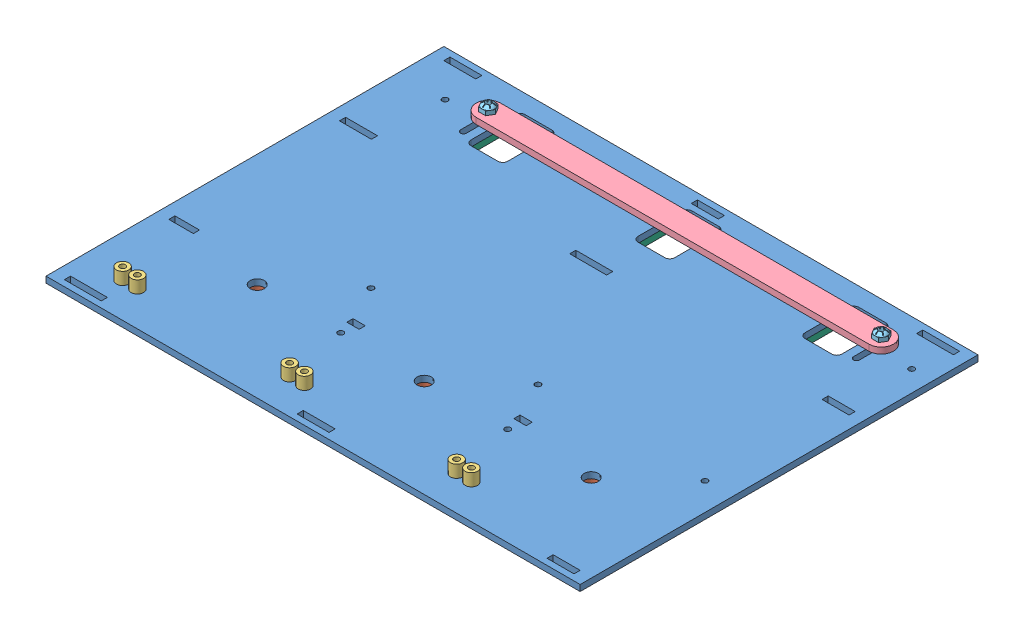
SolidWorks assembly TopAssembly.SLDASM, configuration Default (file format 7000). Lengths in mm.
Overall size (276.23 41.27 205.74).
20 component instances, 9 part files, 33 mates.
Components (placement in the parent):
- TopPanel-1: TopPanel.SLDPRT [Default] at (-16.6534 141.8014 300.2711) size (276.23 3.17 205.74)
- InputBacking-1: InputBacking.SLDPRT [Default] at (41.7666 138.6264 249.4711) size (81.07 3.17 76.2)
- Spacer-0p25-1s4-1: Spacer-0p25-1s4.SLDPRT [Default] at (12.7674 151.3264 282.4432) x (0.646996 0 -0.762494) z (0 -1 0) size (6.35 6.35 6.35)
- Spacer-0p25-1s4-2: Spacer-0p25-1s4.SLDPRT [Default] at (5.1474 151.3264 282.4432) x (0.139598 0 -0.990208) z (0 -1 0) size (6.35 6.35 6.35)
- FingerStop-1: FingerStop.SLDPRT [Default] at (5.1474 151.3264 282.4432) size (35.67 3.17 18.43)
- InputBacking-2: InputBacking.SLDPRT [Default] at (128.1266 138.6264 249.4711) size (81.07 3.17 76.2)
- Spacer-0p25-1s4-3: Spacer-0p25-1s4.SLDPRT [Default] at (91.5074 151.3264 282.4432) x (0.999262 0 0.038412) z (0 -1 0) size (6.35 6.35 6.35)
- Spacer-0p25-1s4-4: Spacer-0p25-1s4.SLDPRT [Default] at (99.1274 151.3264 282.4432) x (0.62391 0 0.781496) z (0 -1 0) size (6.35 6.35 6.35)
- FingerStop-3: FingerStop.SLDPRT [Default] at (91.5074 151.3264 282.4432) size (35.67 3.17 18.43)
- InputBacking-3: InputBacking.SLDPRT [Default] at (214.4866 138.6264 249.4711) size (81.07 3.17 76.2)
- Spacer-0p25-1s4-5: Spacer-0p25-1s4.SLDPRT [Default] at (185.4874 151.3264 282.4432) x (0.993795 0 0.111224) z (0 -1 0) size (6.35 6.35 6.35)
- Spacer-0p25-1s4-6: Spacer-0p25-1s4.SLDPRT [Default] at (177.8674 151.3264 282.4432) x (0.413398 0 0.91055) z (0 -1 0) size (6.35 6.35 6.35)
- FingerStop-4: FingerStop.SLDPRT [Default] at (177.8674 151.3264 282.4432) size (35.67 3.17 18.43)
- ReadoutCover-1: ReadoutCover.SLDPRT [Default] at (26.5774 144.9764 114.7787) size (215.9 3.17 12.7)
- Locknut-1: Locknut.SLDPRT [Default] at (26.5774 150.2723 114.7787) x (1 0 0) z (0 -1 0) size (7.33 6.35 3.56)
- Locknut-2: Locknut.SLDPRT [Default] at (229.7774 150.2723 114.7787) x (1 0 0) z (0 -1 0) size (7.33 6.35 3.56)
- ReadoutShield-1: ReadoutShield.SLDPRT [Default] at (1.1266 138.6264 133.2661) size (254 3.17 30.48)
- InputBrace-1: InputBrace.SLDPRT [Default] at (36.0516 113.2264 249.4711) size (196.85 3.17 12.7)
- Standoff-1in-1s4-1: Standoff-1in-1s4.SLDPRT [Default] at (171.3066 141.8014 249.4711) x (1 0 0) z (0 -1 0) size (6.35 6.35 25.4)
- Standoff-1in-1s4-2: Standoff-1in-1s4.SLDPRT [Default] at (84.9466 141.8014 249.4711) x (-0.986882 0 0.161445) z (0 -1 0) size (6.35 6.35 25.4)
Mates (geometry in assembly coordinates):
- Coincident20: coincident anti-aligned: circle of TopPanel-1; circle of Spacer-0p25-1s4-1
- Coincident21: coincident anti-aligned: circle of TopPanel-1; circle of Spacer-0p25-1s4-2
- Coincident25: coincident anti-aligned: circle of TopPanel-1; circle of Spacer-0p25-1s4-3
- Coincident29: coincident anti-aligned: circle of TopPanel-1; circle of Spacer-0p25-1s4-6
- Coincident35: coincident anti-aligned: plane of TopPanel-1 through (-16.6534 144.9764 300.2711) normal (0 1 0); plane of ReadoutCover-1 through (26.5774 144.9764 114.7787) normal (0 -1 0)
- Coincident38: coincident anti-aligned: circle of ReadoutCover-1; circle of Locknut-1
- Coincident39: coincident anti-aligned: circle of ReadoutCover-1; circle of Locknut-2
- Parallel1: parallel aligned: line of TopPanel-1 through (259.5716 144.9764 94.5311) axis (-1 0 0); line of ReadoutCover-1 through (229.7774 148.1514 108.4287) axis (-1 0 0)
- Coincident42: coincident anti-aligned: plane of TopPanel-1 through (-16.6534 141.8014 300.2711) normal (0 -1 0); plane of ReadoutShield-1 through (1.1266 141.8014 133.2661) normal (0 1 0)
- Tangent5: tangent anti-aligned: plane of TopPanel-1 through (28.0506 144.9764 108.5011) normal (-1 0 0); cylinder of ReadoutCover-1 through (26.5774 148.1514 114.7787) axis (0 1 0) radius 1.4732
- Coincident43: coincident aligned: circle of TopPanel-1; circle of ReadoutShield-1
- Coincident44: coincident aligned: circle of TopPanel-1; circle of ReadoutShield-1
- Coincident45: coincident anti-aligned: circle of Spacer-0p25-1s4-2; circle of FingerStop-1
- Coincident46: coincident anti-aligned: circle of Spacer-0p25-1s4-1; circle of FingerStop-1
- Coincident48: coincident anti-aligned: circle of TopPanel-1; circle of Spacer-0p25-1s4-4
- Coincident49: coincident anti-aligned: circle of Spacer-0p25-1s4-3; circle of FingerStop-3
- Coincident50: coincident anti-aligned: circle of Spacer-0p25-1s4-4; circle of FingerStop-3
- Coincident51: coincident anti-aligned: circle of TopPanel-1; cylinder of Spacer-0p25-1s4-5 through (185.4874 144.9764 282.4432) axis (0 -1 0) radius 1.4732
- Coincident52: coincident anti-aligned: plane of TopPanel-1 through (-16.6534 144.9764 300.2711) normal (0 1 0); plane of Spacer-0p25-1s4-5 through (185.4874 144.9764 282.4432) normal (0 -1 0)
- Coincident53: coincident anti-aligned: circle of Spacer-0p25-1s4-6; cylinder of FingerStop-4 through (177.8674 154.5014 282.4432) axis (0 1 0) radius 1.4732
- Coincident54: coincident anti-aligned: circle of Spacer-0p25-1s4-5; circle of FingerStop-4
- Coincident55: coincident aligned: circle of TopPanel-1; circle of InputBacking-1
- Concentric1: concentric aligned: circle of InputBacking-3; circle of InputBrace-1
- Concentric2: concentric aligned: circle of TopPanel-1; circle of InputBacking-1
- Coincident57: coincident anti-aligned: circle of TopPanel-1; circle of Standoff-1in-1s4-1
- Coincident58: coincident anti-aligned: circle of InputBrace-1; circle of Standoff-1in-1s4-1
- Coincident59: coincident anti-aligned: circle of TopPanel-1; circle of Standoff-1in-1s4-2
- Coincident60: coincident aligned: circle of TopPanel-1; circle of InputBacking-1
- Coincident61: coincident aligned: circle of TopPanel-1; circle of InputBacking-2
- Coincident62: coincident aligned: circle of TopPanel-1; circle of InputBacking-2
- Coincident63: coincident anti-aligned: circle of InputBrace-1; circle of Standoff-1in-1s4-2
- Coincident64: coincident aligned: circle of TopPanel-1; circle of InputBacking-3
- Concentric3: concentric anti-aligned: circle of InputBacking-3; circle of Spacer-0p25-1s4-5
